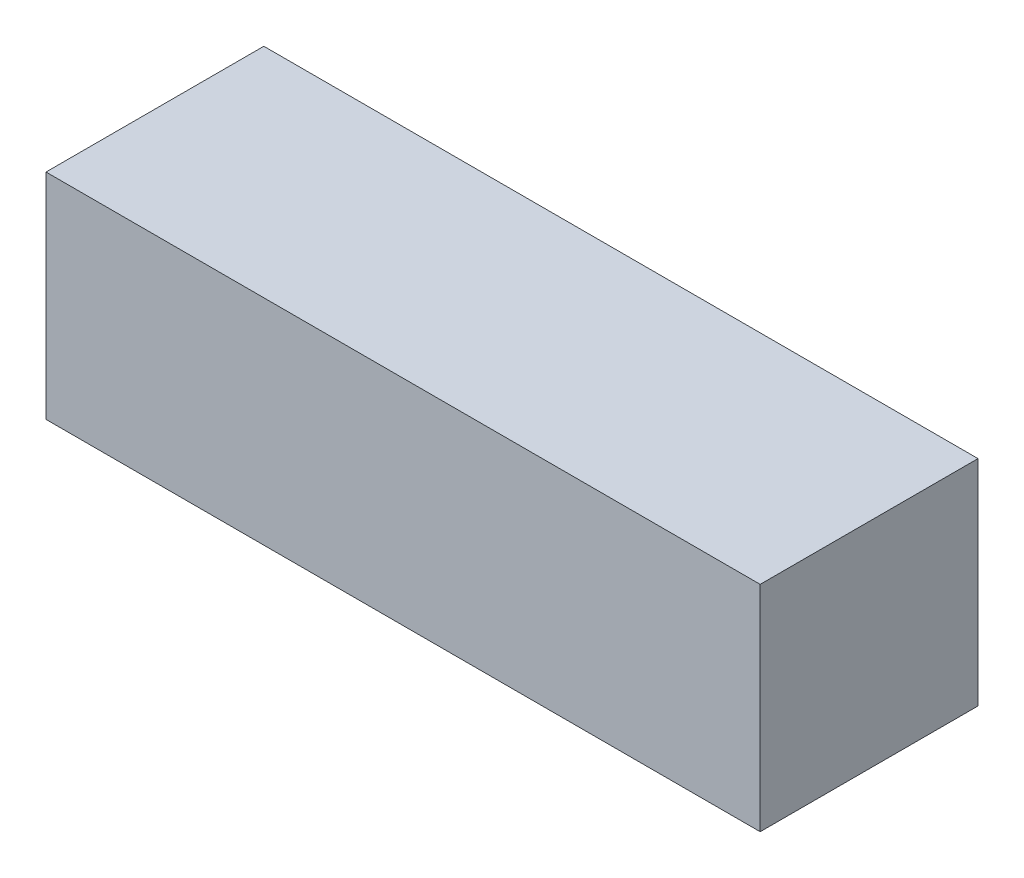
ISO-10303-21;
HEADER;
FILE_DESCRIPTION(('STEP AP214'),'2;1');
FILE_NAME('part.step','',(''),(''),'','','');
FILE_SCHEMA(('AUTOMOTIVE_DESIGN { 1 0 10303 214 1 1 1 1 }'));
ENDSEC;
DATA;
#1=APPLICATION_CONTEXT('core data for automotive mechanical design processes');
#2=APPLICATION_PROTOCOL_DEFINITION('international standard','automotive_design',2000,#1);
#3=PRODUCT_CONTEXT('',#1,'mechanical');
#4=PRODUCT('Part','Part','',(#3));
#5=PRODUCT_RELATED_PRODUCT_CATEGORY('part','',(#4));
#6=PRODUCT_DEFINITION_FORMATION('','',#4);
#7=PRODUCT_DEFINITION_CONTEXT('part definition',#1,'design');
#8=PRODUCT_DEFINITION('design','',#6,#7);
#9=PRODUCT_DEFINITION_SHAPE('','',#8);
#10=(LENGTH_UNIT() NAMED_UNIT(*) SI_UNIT(.MILLI.,.METRE.));
#11=(NAMED_UNIT(*) PLANE_ANGLE_UNIT() SI_UNIT($,.RADIAN.));
#12=(NAMED_UNIT(*) SI_UNIT($,.STERADIAN.) SOLID_ANGLE_UNIT());
#13=UNCERTAINTY_MEASURE_WITH_UNIT(LENGTH_MEASURE(1.E-05),#10,'distance_accuracy_value','');
#14=(GEOMETRIC_REPRESENTATION_CONTEXT(3) GLOBAL_UNCERTAINTY_ASSIGNED_CONTEXT((#13)) GLOBAL_UNIT_ASSIGNED_CONTEXT((#10,
#11,#12)) REPRESENTATION_CONTEXT('',''));
#15=CARTESIAN_POINT('',(0.,0.,0.));
#16=DIRECTION('',(0.,0.,1.));
#17=DIRECTION('',(1.,0.,0.));
#18=AXIS2_PLACEMENT_3D('',#15,#16,#17);
#19=CARTESIAN_POINT('',(0.,0.,30.5));
#20=DIRECTION('',(1.,0.,0.));
#21=DIRECTION('',(0.,1.,0.));
#22=AXIS2_PLACEMENT_3D('',#19,#20,#21);
#23=PLANE('',#22);
#24=DIRECTION('',(0.,-1.,0.));
#25=VECTOR('',#24,1.);
#26=CARTESIAN_POINT('',(0.,0.,-30.5));
#27=LINE('',#26,#25);
#28=CARTESIAN_POINT('',(0.,60.,-30.5));
#29=VERTEX_POINT('',#28);
#30=CARTESIAN_POINT('',(0.,0.,-30.5));
#31=VERTEX_POINT('',#30);
#32=EDGE_CURVE('E95',#29,#31,#27,.T.);
#33=ORIENTED_EDGE('',*,*,#32,.T.);
#34=DIRECTION('',(0.,0.,-1.));
#35=VECTOR('',#34,1.);
#36=CARTESIAN_POINT('',(0.,0.,30.5));
#37=LINE('',#36,#35);
#38=CARTESIAN_POINT('',(0.,0.,30.5));
#39=VERTEX_POINT('',#38);
#40=EDGE_CURVE('E11',#39,#31,#37,.T.);
#41=ORIENTED_EDGE('',*,*,#40,.F.);
#42=DIRECTION('',(0.,-1.,0.));
#43=VECTOR('',#42,1.);
#44=CARTESIAN_POINT('',(0.,0.,30.5));
#45=LINE('',#44,#43);
#46=CARTESIAN_POINT('',(0.,60.,30.5));
#47=VERTEX_POINT('',#46);
#48=EDGE_CURVE('E83',#47,#39,#45,.T.);
#49=ORIENTED_EDGE('',*,*,#48,.F.);
#50=DIRECTION('',(0.,0.,-1.));
#51=VECTOR('',#50,1.);
#52=CARTESIAN_POINT('',(0.,60.,30.5));
#53=LINE('',#52,#51);
#54=EDGE_CURVE('E91',#47,#29,#53,.T.);
#55=ORIENTED_EDGE('',*,*,#54,.T.);
#56=EDGE_LOOP('',(#33,#41,#49,#55));
#57=FACE_BOUND('',#56,.T.);
#58=ADVANCED_FACE('F32',(#57),#23,.F.);
#59=CARTESIAN_POINT('',(0.,0.,30.5));
#60=DIRECTION('',(0.,1.,0.));
#61=DIRECTION('',(0.,0.,1.));
#62=AXIS2_PLACEMENT_3D('',#59,#60,#61);
#63=PLANE('',#62);
#64=DIRECTION('',(1.,0.,0.));
#65=VECTOR('',#64,1.);
#66=CARTESIAN_POINT('',(0.,0.,-30.5));
#67=LINE('',#66,#65);
#68=CARTESIAN_POINT('',(200.,0.,-30.5));
#69=VERTEX_POINT('',#68);
#70=EDGE_CURVE('E87',#31,#69,#67,.T.);
#71=ORIENTED_EDGE('',*,*,#70,.T.);
#72=DIRECTION('',(0.,0.,-1.));
#73=VECTOR('',#72,1.);
#74=CARTESIAN_POINT('',(200.,0.,30.5));
#75=LINE('',#74,#73);
#76=CARTESIAN_POINT('',(200.,0.,30.5));
#77=VERTEX_POINT('',#76);
#78=EDGE_CURVE('E40',#77,#69,#75,.T.);
#79=ORIENTED_EDGE('',*,*,#78,.F.);
#80=DIRECTION('',(1.,0.,0.));
#81=VECTOR('',#80,1.);
#82=CARTESIAN_POINT('',(0.,0.,30.5));
#83=LINE('',#82,#81);
#84=EDGE_CURVE('E78',#39,#77,#83,.T.);
#85=ORIENTED_EDGE('',*,*,#84,.F.);
#86=ORIENTED_EDGE('',*,*,#40,.T.);
#87=EDGE_LOOP('',(#71,#79,#85,#86));
#88=FACE_BOUND('',#87,.T.);
#89=ADVANCED_FACE('F86',(#88),#63,.F.);
#90=CARTESIAN_POINT('',(200.,0.,30.5));
#91=DIRECTION('',(-1.,0.,0.));
#92=DIRECTION('',(0.,0.,1.));
#93=AXIS2_PLACEMENT_3D('',#90,#91,#92);
#94=PLANE('',#93);
#95=DIRECTION('',(0.,1.,0.));
#96=VECTOR('',#95,1.);
#97=CARTESIAN_POINT('',(200.,0.,-30.5));
#98=LINE('',#97,#96);
#99=CARTESIAN_POINT('',(200.,60.,-30.5));
#100=VERTEX_POINT('',#99);
#101=EDGE_CURVE('E65',#69,#100,#98,.T.);
#102=ORIENTED_EDGE('',*,*,#101,.T.);
#103=DIRECTION('',(0.,0.,-1.));
#104=VECTOR('',#103,1.);
#105=CARTESIAN_POINT('',(200.,60.,30.5));
#106=LINE('',#105,#104);
#107=CARTESIAN_POINT('',(200.,60.,30.5));
#108=VERTEX_POINT('',#107);
#109=EDGE_CURVE('E88',#108,#100,#106,.T.);
#110=ORIENTED_EDGE('',*,*,#109,.F.);
#111=DIRECTION('',(0.,1.,0.));
#112=VECTOR('',#111,1.);
#113=CARTESIAN_POINT('',(200.,0.,30.5));
#114=LINE('',#113,#112);
#115=EDGE_CURVE('E81',#77,#108,#114,.T.);
#116=ORIENTED_EDGE('',*,*,#115,.F.);
#117=ORIENTED_EDGE('',*,*,#78,.T.);
#118=EDGE_LOOP('',(#102,#110,#116,#117));
#119=FACE_BOUND('',#118,.T.);
#120=ADVANCED_FACE('F89',(#119),#94,.F.);
#121=CARTESIAN_POINT('',(0.,60.,30.5));
#122=DIRECTION('',(0.,-1.,0.));
#123=DIRECTION('',(0.,0.,-1.));
#124=AXIS2_PLACEMENT_3D('',#121,#122,#123);
#125=PLANE('',#124);
#126=DIRECTION('',(-1.,0.,0.));
#127=VECTOR('',#126,1.);
#128=CARTESIAN_POINT('',(0.,60.,-30.5));
#129=LINE('',#128,#127);
#130=EDGE_CURVE('E71',#100,#29,#129,.T.);
#131=ORIENTED_EDGE('',*,*,#130,.T.);
#132=ORIENTED_EDGE('',*,*,#54,.F.);
#133=DIRECTION('',(-1.,0.,0.));
#134=VECTOR('',#133,1.);
#135=CARTESIAN_POINT('',(0.,60.,30.5));
#136=LINE('',#135,#134);
#137=EDGE_CURVE('E48',#108,#47,#136,.T.);
#138=ORIENTED_EDGE('',*,*,#137,.F.);
#139=ORIENTED_EDGE('',*,*,#109,.T.);
#140=EDGE_LOOP('',(#131,#132,#138,#139));
#141=FACE_BOUND('',#140,.T.);
#142=ADVANCED_FACE('F102',(#141),#125,.F.);
#143=CARTESIAN_POINT('',(0.,60.,30.5));
#144=DIRECTION('',(0.,0.,-1.));
#145=DIRECTION('',(-1.,0.,0.));
#146=AXIS2_PLACEMENT_3D('',#143,#144,#145);
#147=PLANE('',#146);
#148=ORIENTED_EDGE('',*,*,#48,.T.);
#149=ORIENTED_EDGE('',*,*,#84,.T.);
#150=ORIENTED_EDGE('',*,*,#115,.T.);
#151=ORIENTED_EDGE('',*,*,#137,.T.);
#152=EDGE_LOOP('',(#148,#149,#150,#151));
#153=FACE_BOUND('',#152,.T.);
#154=ADVANCED_FACE('F79',(#153),#147,.F.);
#155=CARTESIAN_POINT('',(0.,60.,-30.5));
#156=DIRECTION('',(0.,0.,-1.));
#157=DIRECTION('',(-1.,0.,0.));
#158=AXIS2_PLACEMENT_3D('',#155,#156,#157);
#159=PLANE('',#158);
#160=ORIENTED_EDGE('',*,*,#32,.F.);
#161=ORIENTED_EDGE('',*,*,#130,.F.);
#162=ORIENTED_EDGE('',*,*,#101,.F.);
#163=ORIENTED_EDGE('',*,*,#70,.F.);
#164=EDGE_LOOP('',(#160,#161,#162,#163));
#165=FACE_BOUND('',#164,.T.);
#166=ADVANCED_FACE('F105',(#165),#159,.T.);
#167=CLOSED_SHELL('',(#58,#89,#120,#142,#154,#166));
#168=MANIFOLD_SOLID_BREP('B2',#167);
#169=ADVANCED_BREP_SHAPE_REPRESENTATION('',(#18,#168),#14);
#170=SHAPE_DEFINITION_REPRESENTATION(#9,#169);
ENDSEC;
END-ISO-10303-21;
